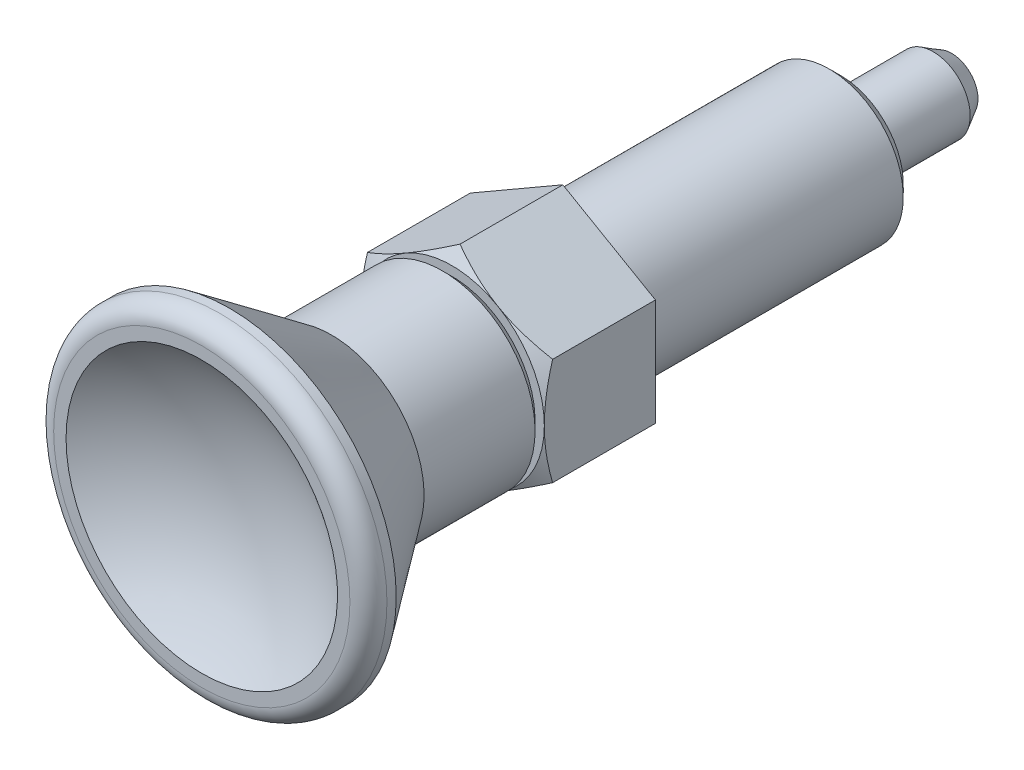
ISO-10303-21;
HEADER;
FILE_DESCRIPTION(('STEP AP214'),'2;1');
FILE_NAME('part.step','',(''),(''),'','','');
FILE_SCHEMA(('AUTOMOTIVE_DESIGN { 1 0 10303 214 1 1 1 1 }'));
ENDSEC;
DATA;
#1=APPLICATION_CONTEXT('core data for automotive mechanical design processes');
#2=APPLICATION_PROTOCOL_DEFINITION('international standard','automotive_design',2000,#1);
#3=PRODUCT_CONTEXT('',#1,'mechanical');
#4=PRODUCT('Part','Part','',(#3));
#5=PRODUCT_RELATED_PRODUCT_CATEGORY('part','',(#4));
#6=PRODUCT_DEFINITION_FORMATION('','',#4);
#7=PRODUCT_DEFINITION_CONTEXT('part definition',#1,'design');
#8=PRODUCT_DEFINITION('design','',#6,#7);
#9=PRODUCT_DEFINITION_SHAPE('','',#8);
#10=(LENGTH_UNIT() NAMED_UNIT(*) SI_UNIT(.MILLI.,.METRE.));
#11=(NAMED_UNIT(*) PLANE_ANGLE_UNIT() SI_UNIT($,.RADIAN.));
#12=(NAMED_UNIT(*) SI_UNIT($,.STERADIAN.) SOLID_ANGLE_UNIT());
#13=UNCERTAINTY_MEASURE_WITH_UNIT(LENGTH_MEASURE(1.E-05),#10,'distance_accuracy_value','');
#14=(GEOMETRIC_REPRESENTATION_CONTEXT(3) GLOBAL_UNCERTAINTY_ASSIGNED_CONTEXT((#13)) GLOBAL_UNIT_ASSIGNED_CONTEXT((#10,
#11,#12)) REPRESENTATION_CONTEXT('',''));
#15=CARTESIAN_POINT('',(0.,0.,0.));
#16=DIRECTION('',(0.,0.,1.));
#17=DIRECTION('',(1.,0.,0.));
#18=AXIS2_PLACEMENT_3D('',#15,#16,#17);
#19=CARTESIAN_POINT('',(0.,0.,4.2679491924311));
#20=DIRECTION('',(0.,0.,-1.));
#21=DIRECTION('',(1.,0.,0.));
#22=AXIS2_PLACEMENT_3D('',#19,#20,#21);
#23=CONICAL_SURFACE('',#22,8.,1.0471975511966);
#24=CARTESIAN_POINT('',(-5.,7.83582824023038,3.52018185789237));
#25=CARTESIAN_POINT('',(-5.,7.61675258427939,3.62677894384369));
#26=CARTESIAN_POINT('',(-5.,7.39718272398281,3.73237731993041));
#27=CARTESIAN_POINT('',(-5.,6.95679209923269,3.94101657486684));
#28=CARTESIAN_POINT('',(-5.,6.73597115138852,4.04405706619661));
#29=CARTESIAN_POINT('',(-5.,6.29171673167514,4.24752156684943));
#30=CARTESIAN_POINT('',(-5.,6.06827562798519,4.34792896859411));
#31=CARTESIAN_POINT('',(-5.,5.61964466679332,4.54474266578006));
#32=CARTESIAN_POINT('',(-5.,5.39445489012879,4.64114914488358));
#33=CARTESIAN_POINT('',(-5.,4.93438073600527,4.83205603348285));
#34=CARTESIAN_POINT('',(-5.,4.69942447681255,4.92638413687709));
#35=CARTESIAN_POINT('',(-5.,4.22679335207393,5.10809698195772));
#36=CARTESIAN_POINT('',(-5.,3.98911818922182,5.19548095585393));
#37=CARTESIAN_POINT('',(-5.,3.51109032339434,5.361071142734));
#38=CARTESIAN_POINT('',(-5.,3.27074388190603,5.43929525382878));
#39=CARTESIAN_POINT('',(-5.,2.78660382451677,5.58410963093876));
#40=CARTESIAN_POINT('',(-5.,2.54281129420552,5.65070347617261));
#41=CARTESIAN_POINT('',(-5.,2.05301710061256,5.76875493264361));
#42=CARTESIAN_POINT('',(-5.,1.80703640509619,5.8202979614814));
#43=CARTESIAN_POINT('',(-5.,1.31193168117,5.90539626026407));
#44=CARTESIAN_POINT('',(-5.,1.06280797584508,5.9389533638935));
#45=CARTESIAN_POINT('',(-5.,0.565948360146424,5.98496717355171));
#46=CARTESIAN_POINT('',(-5.,0.318238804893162,5.99770143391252));
#47=CARTESIAN_POINT('',(-5.,-0.177377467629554,6.00172580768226));
#48=CARTESIAN_POINT('',(-5.,-0.42528418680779,5.99301571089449));
#49=CARTESIAN_POINT('',(-5.,-0.84377235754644,5.96083600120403));
#50=CARTESIAN_POINT('',(-5.,-1.01479089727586,5.94270146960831));
#51=CARTESIAN_POINT('',(-5.,-1.35562158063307,5.89731277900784));
#52=CARTESIAN_POINT('',(-5.,-1.52543356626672,5.87005744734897));
#53=CARTESIAN_POINT('',(-5.,-2.03280883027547,5.77603792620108));
#54=CARTESIAN_POINT('',(-5.,-2.36813213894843,5.69703587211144));
#55=CARTESIAN_POINT('',(-5.,-2.86963272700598,5.55946652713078));
#56=CARTESIAN_POINT('',(-5.,-3.03839424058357,5.50977811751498));
#57=CARTESIAN_POINT('',(-5.,-3.37427940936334,5.40509537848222));
#58=CARTESIAN_POINT('',(-5.,-3.54140305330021,5.35010101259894));
#59=CARTESIAN_POINT('',(-5.,-3.8740625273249,5.23570084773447));
#60=CARTESIAN_POINT('',(-5.,-4.03959882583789,5.17629639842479));
#61=CARTESIAN_POINT('',(-5.,-4.36929036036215,5.05378935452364));
#62=CARTESIAN_POINT('',(-5.,-4.53344561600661,4.99068681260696));
#63=CARTESIAN_POINT('',(-5.,-4.93359002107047,4.83251408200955));
#64=CARTESIAN_POINT('',(-5.,-5.16891080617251,4.73575576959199));
#65=CARTESIAN_POINT('',(-5.,-5.63743106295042,4.53721704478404));
#66=CARTESIAN_POINT('',(-5.,-5.87063037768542,4.43543626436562));
#67=CARTESIAN_POINT('',(-5.,-6.33531777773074,4.22790414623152));
#68=CARTESIAN_POINT('',(-5.,-6.56680543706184,4.12215185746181));
#69=CARTESIAN_POINT('',(-5.,-7.02832278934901,3.90750642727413));
#70=CARTESIAN_POINT('',(-5.,-7.25835244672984,3.79861320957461));
#71=CARTESIAN_POINT('',(-5.,-7.71747583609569,3.57816832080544));
#72=CARTESIAN_POINT('',(-5.,-7.94656809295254,3.46661358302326));
#73=CARTESIAN_POINT('',(-5.,-8.40373705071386,3.2414402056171));
#74=CARTESIAN_POINT('',(-5.,-8.63181374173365,3.12782154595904));
#75=CARTESIAN_POINT('',(-5.,-9.31470112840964,2.78447519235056));
#76=CARTESIAN_POINT('',(-5.,-9.76824174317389,2.55222195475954));
#77=CARTESIAN_POINT('',(-5.,-10.6324695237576,2.10400639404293));
#78=CARTESIAN_POINT('',(-5.,-11.0433644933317,1.88844288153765));
#79=CARTESIAN_POINT('',(-5.,-11.863638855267,1.45441184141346));
#80=CARTESIAN_POINT('',(-5.,-12.2730181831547,1.23594419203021));
#81=CARTESIAN_POINT('',(-5.,-13.0894643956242,0.797423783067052));
#82=CARTESIAN_POINT('',(-5.,-13.4965345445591,0.577377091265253));
#83=CARTESIAN_POINT('',(-5.,-14.3097130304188,0.135572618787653));
#84=CARTESIAN_POINT('',(-5.,-14.7158214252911,-0.0861850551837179));
#85=CARTESIAN_POINT('',(-5.,-15.1215799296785,-0.308576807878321));
#86=B_SPLINE_CURVE_WITH_KNOTS('',3,(#24,#25,#26,#27,#28,#29,#30,#31,#32,#33,#34,#35,#36,#37,#38,
#39,#40,#41,#42,#43,#44,#45,#46,#47,#48,#49,#50,#51,#52,#53,#54,#55,#56,#57,#58,#59,#60,#61,#62,
#63,#64,#65,#66,#67,#68,#69,#70,#71,#72,#73,#74,#75,#76,#77,#78,#79,#80,#81,#82,#83,#84,#85),
.UNSPECIFIED.,.F.,.F.,(4,2,2,2,2,2,2,2,2,2,2,2,2,2,2,2,2,2,2,2,2,2,2,2,2,2,2,2,2,2,4),(0.,
0.730907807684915,1.46192568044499,2.19678752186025,2.93161559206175,3.69108328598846,
4.45063483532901,5.20867656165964,5.96648458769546,6.71990430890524,7.47324720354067,
8.21646418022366,8.95968844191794,9.47537174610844,9.99112137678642,11.0231580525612,
11.5508843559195,12.0786142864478,12.6061833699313,13.1337449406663,13.8969744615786,
14.6602599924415,15.4237294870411,16.1872175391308,16.9516324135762,17.7160547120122,
19.2446573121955,20.6366654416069,22.0287321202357,23.4169424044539,24.8050668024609),.UNSPECIFIED.);
#87=CARTESIAN_POINT('',(-5.,-2.8867513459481,5.55341801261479));
#88=VERTEX_POINT('',#87);
#89=CARTESIAN_POINT('',(-5.,0.,6.));
#90=VERTEX_POINT('',#89);
#91=EDGE_CURVE('E9',#88,#90,#86,.F.);
#92=ORIENTED_EDGE('',*,*,#91,.F.);
#93=CARTESIAN_POINT('',(0.000200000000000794,-5.77361816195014,5.55335134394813));
#94=CARTESIAN_POINT('',(-0.219534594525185,-5.64675433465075,5.62661343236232));
#95=CARTESIAN_POINT('',(-0.441148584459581,-5.51880543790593,5.69324867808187));
#96=CARTESIAN_POINT('',(-0.888213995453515,-5.26069210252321,5.80956100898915));
#97=CARTESIAN_POINT('',(-1.11367335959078,-5.13052307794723,5.85919695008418));
#98=CARTESIAN_POINT('',(-1.56183230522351,-4.87177839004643,5.93644897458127));
#99=CARTESIAN_POINT('',(-1.7844620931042,-4.74324302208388,5.96457962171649));
#100=CARTESIAN_POINT('',(-2.11918990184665,-4.54998783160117,5.98980507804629));
#101=CARTESIAN_POINT('',(-2.23084219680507,-4.48552534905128,5.99538654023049));
#102=CARTESIAN_POINT('',(-2.45424997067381,-4.35654081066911,6.00079778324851));
#103=CARTESIAN_POINT('',(-2.56600544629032,-4.2920187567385,6.00062774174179));
#104=CARTESIAN_POINT('',(-2.87218423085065,-4.11524635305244,5.99224636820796));
#105=CARTESIAN_POINT('',(-3.06650608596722,-4.00305457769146,5.97817022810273));
#106=CARTESIAN_POINT('',(-3.45386010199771,-3.77941563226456,5.93353474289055));
#107=CARTESIAN_POINT('',(-3.64689090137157,-3.66796924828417,5.90296013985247));
#108=CARTESIAN_POINT('',(-4.03502534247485,-3.44387972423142,5.82653150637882));
#109=CARTESIAN_POINT('',(-4.23007999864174,-3.33126486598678,5.7803536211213));
#110=CARTESIAN_POINT('',(-4.61728034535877,-3.10771464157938,5.67554820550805));
#111=CARTESIAN_POINT('',(-4.80943099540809,-2.99677641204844,5.61694529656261));
#112=CARTESIAN_POINT('',(-5.0002,-2.88663587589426,5.55335134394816));
#113=B_SPLINE_CURVE_WITH_KNOTS('',3,(#93,#94,#95,#96,#97,#98,#99,#100,#101,#102,#103,#104,#105,
#106,#107,#108,#109,#110,#111,#112),.UNSPECIFIED.,.F.,.F.,(4,2,2,2,2,2,2,2,2,4),(0.,
0.792555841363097,1.58701660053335,2.36181537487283,2.74884076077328,3.13585419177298,
3.80962362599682,4.48401723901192,5.17336882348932,5.86136694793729),.UNSPECIFIED.);
#114=CARTESIAN_POINT('',(-2.50000000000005,-4.33012701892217,6.));
#115=VERTEX_POINT('',#114);
#116=EDGE_CURVE('E203',#115,#88,#113,.T.);
#117=ORIENTED_EDGE('',*,*,#116,.F.);
#118=CARTESIAN_POINT('',(0.,0.,6.));
#119=DIRECTION('',(0.,0.,1.));
#120=DIRECTION('',(-1.,0.,0.));
#121=AXIS2_PLACEMENT_3D('',#118,#119,#120);
#122=CIRCLE('',#121,5.);
#123=EDGE_CURVE('E124',#90,#115,#122,.T.);
#124=ORIENTED_EDGE('',*,*,#123,.F.);
#125=EDGE_LOOP('',(#92,#117,#124));
#126=FACE_BOUND('',#125,.T.);
#127=ADVANCED_FACE('F14',(#126),#23,.T.);
#128=CARTESIAN_POINT('',(-5.,2.8867513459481,5.55341801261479));
#129=VERTEX_POINT('',#128);
#130=EDGE_CURVE('E18',#90,#129,#86,.F.);
#131=ORIENTED_EDGE('',*,*,#130,.F.);
#132=CARTESIAN_POINT('',(-2.50000000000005,4.33012701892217,6.));
#133=VERTEX_POINT('',#132);
#134=EDGE_CURVE('E116',#133,#90,#122,.T.);
#135=ORIENTED_EDGE('',*,*,#134,.F.);
#136=CARTESIAN_POINT('',(-5.0002,2.88663587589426,5.55335134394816));
#137=CARTESIAN_POINT('',(-4.78046540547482,3.01349970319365,5.62661343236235));
#138=CARTESIAN_POINT('',(-4.55885141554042,3.14144859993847,5.69324867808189));
#139=CARTESIAN_POINT('',(-4.11178600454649,3.39956193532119,5.80956100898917));
#140=CARTESIAN_POINT('',(-3.88632664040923,3.52973095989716,5.85919695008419));
#141=CARTESIAN_POINT('',(-3.43816769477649,3.78847564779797,5.93644897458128));
#142=CARTESIAN_POINT('',(-3.21553790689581,3.91701101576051,5.96457962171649));
#143=CARTESIAN_POINT('',(-2.88081009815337,4.11026620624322,5.98980507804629));
#144=CARTESIAN_POINT('',(-2.76915780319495,4.17472868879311,5.99538654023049));
#145=CARTESIAN_POINT('',(-2.54575002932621,4.30371322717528,6.00079778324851));
#146=CARTESIAN_POINT('',(-2.4339945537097,4.36823528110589,6.00062774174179));
#147=CARTESIAN_POINT('',(-2.12781576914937,4.54500768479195,5.99224636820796));
#148=CARTESIAN_POINT('',(-1.9334939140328,4.65719946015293,5.97817022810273));
#149=CARTESIAN_POINT('',(-1.5461398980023,4.88083840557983,5.93353474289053));
#150=CARTESIAN_POINT('',(-1.35310909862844,4.99228478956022,5.90296013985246));
#151=CARTESIAN_POINT('',(-0.96497465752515,5.21637431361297,5.8265315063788));
#152=CARTESIAN_POINT('',(-0.769920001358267,5.32898917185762,5.78035362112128));
#153=CARTESIAN_POINT('',(-0.382719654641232,5.55253939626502,5.67554820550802));
#154=CARTESIAN_POINT('',(-0.190569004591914,5.66347762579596,5.61694529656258));
#155=CARTESIAN_POINT('',(0.000200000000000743,5.77361816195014,5.55335134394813));
#156=B_SPLINE_CURVE_WITH_KNOTS('',3,(#136,#137,#138,#139,#140,#141,#142,#143,#144,#145,#146,
#147,#148,#149,#150,#151,#152,#153,#154,#155),.UNSPECIFIED.,.F.,.F.,(4,2,2,2,2,2,2,2,2,4),(0.,
0.792555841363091,1.58701660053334,2.36181537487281,2.74884076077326,3.13585419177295,
3.8096236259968,4.48401723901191,5.17336882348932,5.86136694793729),.UNSPECIFIED.);
#157=EDGE_CURVE('E262',#129,#133,#156,.T.);
#158=ORIENTED_EDGE('',*,*,#157,.F.);
#159=EDGE_LOOP('',(#131,#135,#158));
#160=FACE_BOUND('',#159,.T.);
#161=ADVANCED_FACE('F225',(#160),#23,.T.);
#162=CARTESIAN_POINT('',(0.,5.7735026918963,5.55341801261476));
#163=VERTEX_POINT('',#162);
#164=EDGE_CURVE('E112',#133,#163,#156,.T.);
#165=ORIENTED_EDGE('',*,*,#164,.F.);
#166=CARTESIAN_POINT('',(2.50000000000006,4.33012701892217,6.));
#167=VERTEX_POINT('',#166);
#168=EDGE_CURVE('E110',#167,#133,#122,.T.);
#169=ORIENTED_EDGE('',*,*,#168,.F.);
#170=CARTESIAN_POINT('',(-0.000199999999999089,5.77361816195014,5.55335134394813));
#171=CARTESIAN_POINT('',(0.219534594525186,5.64675433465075,5.62661343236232));
#172=CARTESIAN_POINT('',(0.441148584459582,5.51880543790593,5.69324867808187));
#173=CARTESIAN_POINT('',(0.888213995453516,5.26069210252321,5.80956100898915));
#174=CARTESIAN_POINT('',(1.11367335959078,5.13052307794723,5.85919695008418));
#175=CARTESIAN_POINT('',(1.56183230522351,4.87177839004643,5.93644897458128));
#176=CARTESIAN_POINT('',(1.7844620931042,4.74324302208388,5.96457962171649));
#177=CARTESIAN_POINT('',(2.11918990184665,4.54998783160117,5.98980507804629));
#178=CARTESIAN_POINT('',(2.23084219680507,4.48552534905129,5.99538654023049));
#179=CARTESIAN_POINT('',(2.45424997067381,4.35654081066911,6.00079778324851));
#180=CARTESIAN_POINT('',(2.56600544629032,4.2920187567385,6.00062774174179));
#181=CARTESIAN_POINT('',(2.87218423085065,4.11524635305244,5.99224636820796));
#182=CARTESIAN_POINT('',(3.06650608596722,4.00305457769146,5.97817022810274));
#183=CARTESIAN_POINT('',(3.45386010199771,3.77941563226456,5.93353474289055));
#184=CARTESIAN_POINT('',(3.64689090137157,3.66796924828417,5.90296013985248));
#185=CARTESIAN_POINT('',(4.03502534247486,3.44387972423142,5.82653150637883));
#186=CARTESIAN_POINT('',(4.23007999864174,3.33126486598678,5.78035362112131));
#187=CARTESIAN_POINT('',(4.61728034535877,3.10771464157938,5.67554820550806));
#188=CARTESIAN_POINT('',(4.80943099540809,2.99677641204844,5.61694529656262));
#189=CARTESIAN_POINT('',(5.0002,2.88663587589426,5.55335134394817));
#190=B_SPLINE_CURVE_WITH_KNOTS('',3,(#170,#171,#172,#173,#174,#175,#176,#177,#178,#179,#180,
#181,#182,#183,#184,#185,#186,#187,#188,#189),.UNSPECIFIED.,.F.,.F.,(4,2,2,2,2,2,2,2,2,4),(0.,
0.792555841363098,1.58701660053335,2.36181537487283,2.74884076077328,3.13585419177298,
3.80962362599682,4.48401723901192,5.17336882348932,5.86136694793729),.UNSPECIFIED.);
#191=EDGE_CURVE('E90',#163,#167,#190,.T.);
#192=ORIENTED_EDGE('',*,*,#191,.F.);
#193=EDGE_LOOP('',(#165,#169,#192));
#194=FACE_BOUND('',#193,.T.);
#195=ADVANCED_FACE('F111',(#194),#23,.T.);
#196=CARTESIAN_POINT('',(0.,-5.7735026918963,5.55341801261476));
#197=VERTEX_POINT('',#196);
#198=EDGE_CURVE('E198',#197,#115,#113,.T.);
#199=ORIENTED_EDGE('',*,*,#198,.F.);
#200=CARTESIAN_POINT('',(5.0002,-2.88663587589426,5.55335134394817));
#201=CARTESIAN_POINT('',(4.78046540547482,-3.01349970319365,5.62661343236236));
#202=CARTESIAN_POINT('',(4.55885141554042,-3.14144859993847,5.6932486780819));
#203=CARTESIAN_POINT('',(4.11178600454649,-3.39956193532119,5.80956100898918));
#204=CARTESIAN_POINT('',(3.88632664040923,-3.52973095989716,5.8591969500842));
#205=CARTESIAN_POINT('',(3.4381676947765,-3.78847564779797,5.93644897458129));
#206=CARTESIAN_POINT('',(3.21553790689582,-3.91701101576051,5.9645796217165));
#207=CARTESIAN_POINT('',(2.88081009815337,-4.11026620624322,5.9898050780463));
#208=CARTESIAN_POINT('',(2.76915780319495,-4.1747286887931,5.9953865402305));
#209=CARTESIAN_POINT('',(2.54575002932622,-4.30371322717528,6.00079778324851));
#210=CARTESIAN_POINT('',(2.4339945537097,-4.36823528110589,6.00062774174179));
#211=CARTESIAN_POINT('',(2.12781576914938,-4.54500768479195,5.99224636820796));
#212=CARTESIAN_POINT('',(1.9334939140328,-4.65719946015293,5.97817022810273));
#213=CARTESIAN_POINT('',(1.54613989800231,-4.88083840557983,5.93353474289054));
#214=CARTESIAN_POINT('',(1.35310909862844,-4.99228478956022,5.90296013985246));
#215=CARTESIAN_POINT('',(0.964974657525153,-5.21637431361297,5.8265315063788));
#216=CARTESIAN_POINT('',(0.76992000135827,-5.32898917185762,5.78035362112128));
#217=CARTESIAN_POINT('',(0.382719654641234,-5.55253939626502,5.67554820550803));
#218=CARTESIAN_POINT('',(0.190569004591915,-5.66347762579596,5.61694529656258));
#219=CARTESIAN_POINT('',(-0.000199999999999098,-5.77361816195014,5.55335134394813));
#220=B_SPLINE_CURVE_WITH_KNOTS('',3,(#200,#201,#202,#203,#204,#205,#206,#207,#208,#209,#210,
#211,#212,#213,#214,#215,#216,#217,#218,#219),.UNSPECIFIED.,.F.,.F.,(4,2,2,2,2,2,2,2,2,4),(0.,
0.792555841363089,1.58701660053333,2.36181537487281,2.74884076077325,3.13585419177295,
3.8096236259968,4.48401723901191,5.17336882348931,5.86136694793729),.UNSPECIFIED.);
#221=CARTESIAN_POINT('',(2.50000000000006,-4.33012701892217,6.));
#222=VERTEX_POINT('',#221);
#223=EDGE_CURVE('E100',#222,#197,#220,.T.);
#224=ORIENTED_EDGE('',*,*,#223,.F.);
#225=EDGE_CURVE('E123',#115,#222,#122,.T.);
#226=ORIENTED_EDGE('',*,*,#225,.F.);
#227=EDGE_LOOP('',(#199,#224,#226));
#228=FACE_BOUND('',#227,.T.);
#229=ADVANCED_FACE('F243',(#228),#23,.T.);
#230=CARTESIAN_POINT('',(5.,2.8867513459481,5.5534180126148));
#231=VERTEX_POINT('',#230);
#232=EDGE_CURVE('E94',#167,#231,#190,.T.);
#233=ORIENTED_EDGE('',*,*,#232,.F.);
#234=CARTESIAN_POINT('',(5.,0.,6.));
#235=VERTEX_POINT('',#234);
#236=EDGE_CURVE('E106',#235,#167,#122,.T.);
#237=ORIENTED_EDGE('',*,*,#236,.F.);
#238=CARTESIAN_POINT('',(5.,7.83582824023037,3.52018185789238));
#239=CARTESIAN_POINT('',(5.,7.61675258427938,3.6267789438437));
#240=CARTESIAN_POINT('',(5.,7.39718272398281,3.73237731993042));
#241=CARTESIAN_POINT('',(5.,6.95679209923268,3.94101657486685));
#242=CARTESIAN_POINT('',(5.,6.73597115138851,4.04405706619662));
#243=CARTESIAN_POINT('',(5.,6.29171673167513,4.24752156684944));
#244=CARTESIAN_POINT('',(5.,6.06827562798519,4.34792896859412));
#245=CARTESIAN_POINT('',(5.,5.61964466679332,4.54474266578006));
#246=CARTESIAN_POINT('',(5.,5.39445489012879,4.64114914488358));
#247=CARTESIAN_POINT('',(5.,4.93438073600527,4.83205603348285));
#248=CARTESIAN_POINT('',(5.,4.69942447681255,4.9263841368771));
#249=CARTESIAN_POINT('',(5.,4.22679335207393,5.10809698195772));
#250=CARTESIAN_POINT('',(5.,3.98911818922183,5.19548095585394));
#251=CARTESIAN_POINT('',(5.,3.51109032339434,5.361071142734));
#252=CARTESIAN_POINT('',(5.,3.27074388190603,5.43929525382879));
#253=CARTESIAN_POINT('',(5.,2.78660382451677,5.58410963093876));
#254=CARTESIAN_POINT('',(5.,2.54281129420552,5.65070347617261));
#255=CARTESIAN_POINT('',(5.,2.05301710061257,5.76875493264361));
#256=CARTESIAN_POINT('',(5.,1.80703640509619,5.8202979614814));
#257=CARTESIAN_POINT('',(5.,1.31193168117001,5.90539626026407));
#258=CARTESIAN_POINT('',(5.,1.06280797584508,5.9389533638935));
#259=CARTESIAN_POINT('',(5.,0.56594836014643,5.98496717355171));
#260=CARTESIAN_POINT('',(5.,0.318238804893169,5.99770143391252));
#261=CARTESIAN_POINT('',(5.,-0.177377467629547,6.00172580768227));
#262=CARTESIAN_POINT('',(5.,-0.425284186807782,5.9930157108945));
#263=CARTESIAN_POINT('',(5.,-0.843772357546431,5.96083600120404));
#264=CARTESIAN_POINT('',(5.,-1.01479089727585,5.94270146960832));
#265=CARTESIAN_POINT('',(5.,-1.35562158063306,5.89731277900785));
#266=CARTESIAN_POINT('',(5.,-1.52543356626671,5.87005744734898));
#267=CARTESIAN_POINT('',(5.,-2.03280883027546,5.77603792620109));
#268=CARTESIAN_POINT('',(5.,-2.36813213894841,5.69703587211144));
#269=CARTESIAN_POINT('',(5.,-2.86963272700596,5.55946652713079));
#270=CARTESIAN_POINT('',(5.,-3.03839424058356,5.50977811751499));
#271=CARTESIAN_POINT('',(5.,-3.37427940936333,5.40509537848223));
#272=CARTESIAN_POINT('',(5.,-3.54140305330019,5.35010101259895));
#273=CARTESIAN_POINT('',(5.,-3.87406252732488,5.23570084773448));
#274=CARTESIAN_POINT('',(5.,-4.03959882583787,5.1762963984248));
#275=CARTESIAN_POINT('',(5.,-4.36929036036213,5.05378935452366));
#276=CARTESIAN_POINT('',(5.,-4.53344561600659,4.99068681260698));
#277=CARTESIAN_POINT('',(5.,-4.93359002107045,4.83251408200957));
#278=CARTESIAN_POINT('',(5.,-5.16891080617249,4.735755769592));
#279=CARTESIAN_POINT('',(5.,-5.6374310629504,4.53721704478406));
#280=CARTESIAN_POINT('',(5.,-5.87063037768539,4.43543626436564));
#281=CARTESIAN_POINT('',(5.,-6.33531777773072,4.22790414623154));
#282=CARTESIAN_POINT('',(5.,-6.56680543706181,4.12215185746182));
#283=CARTESIAN_POINT('',(5.,-7.02832278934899,3.90750642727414));
#284=CARTESIAN_POINT('',(5.,-7.25835244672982,3.79861320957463));
#285=CARTESIAN_POINT('',(5.,-7.71747583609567,3.57816832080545));
#286=CARTESIAN_POINT('',(5.,-7.94656809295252,3.46661358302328));
#287=CARTESIAN_POINT('',(5.,-8.40373705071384,3.24144020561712));
#288=CARTESIAN_POINT('',(5.,-8.63181374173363,3.12782154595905));
#289=CARTESIAN_POINT('',(5.,-9.31470112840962,2.78447519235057));
#290=CARTESIAN_POINT('',(5.,-9.76824174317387,2.55222195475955));
#291=CARTESIAN_POINT('',(5.,-10.6324695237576,2.10400639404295));
#292=CARTESIAN_POINT('',(5.,-11.0433644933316,1.88844288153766));
#293=CARTESIAN_POINT('',(5.,-11.863638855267,1.45441184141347));
#294=CARTESIAN_POINT('',(5.,-12.2730181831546,1.23594419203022));
#295=CARTESIAN_POINT('',(5.,-13.0894643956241,0.79742378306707));
#296=CARTESIAN_POINT('',(5.,-13.496534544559,0.577377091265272));
#297=CARTESIAN_POINT('',(5.,-14.3097130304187,0.135572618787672));
#298=CARTESIAN_POINT('',(5.,-14.715821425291,-0.0861850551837));
#299=CARTESIAN_POINT('',(5.,-15.1215799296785,-0.308576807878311));
#300=B_SPLINE_CURVE_WITH_KNOTS('',3,(#238,#239,#240,#241,#242,#243,#244,#245,#246,#247,#248,
#249,#250,#251,#252,#253,#254,#255,#256,#257,#258,#259,#260,#261,#262,#263,#264,#265,#266,#267,
#268,#269,#270,#271,#272,#273,#274,#275,#276,#277,#278,#279,#280,#281,#282,#283,#284,#285,#286,
#287,#288,#289,#290,#291,#292,#293,#294,#295,#296,#297,#298,#299),.UNSPECIFIED.,.F.,.F.,(4,2,2,
2,2,2,2,2,2,2,2,2,2,2,2,2,2,2,2,2,2,2,2,2,2,2,2,2,2,2,4),(0.,0.730907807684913,1.46192568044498,
2.19678752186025,2.93161559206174,3.69108328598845,4.450634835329,5.20867656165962,
5.96648458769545,6.71990430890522,7.47324720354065,8.21646418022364,8.95968844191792,
9.47537174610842,9.99112137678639,11.0231580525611,11.5508843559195,12.0786142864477,
12.6061833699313,13.1337449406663,13.8969744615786,14.6602599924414,15.4237294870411,
16.1872175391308,16.9516324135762,17.7160547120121,19.2446573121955,20.6366654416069,
22.0287321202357,23.4169424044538,24.8050668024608),.UNSPECIFIED.);
#301=EDGE_CURVE('E41',#231,#235,#300,.T.);
#302=ORIENTED_EDGE('',*,*,#301,.F.);
#303=EDGE_LOOP('',(#233,#237,#302));
#304=FACE_BOUND('',#303,.T.);
#305=ADVANCED_FACE('F104',(#304),#23,.T.);
#306=CARTESIAN_POINT('',(5.,-2.8867513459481,5.5534180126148));
#307=VERTEX_POINT('',#306);
#308=EDGE_CURVE('E108',#307,#222,#220,.T.);
#309=ORIENTED_EDGE('',*,*,#308,.F.);
#310=EDGE_CURVE('E168',#235,#307,#300,.T.);
#311=ORIENTED_EDGE('',*,*,#310,.F.);
#312=EDGE_CURVE('E122',#222,#235,#122,.T.);
#313=ORIENTED_EDGE('',*,*,#312,.F.);
#314=EDGE_LOOP('',(#309,#311,#313));
#315=FACE_BOUND('',#314,.T.);
#316=ADVANCED_FACE('F227',(#315),#23,.T.);
#317=CARTESIAN_POINT('',(2.54308990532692E-12,0.,28.9999999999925));
#318=DIRECTION('',(0.,0.,1.));
#319=DIRECTION('',(-1.,0.,0.));
#320=AXIS2_PLACEMENT_3D('',#317,#318,#319);
#321=SPHERICAL_SURFACE('',#320,11.9999999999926);
#322=CARTESIAN_POINT('',(0.,0.,19.5));
#323=DIRECTION('',(0.,0.,1.));
#324=DIRECTION('',(0.,-1.,0.));
#325=AXIS2_PLACEMENT_3D('',#322,#323,#324);
#326=CIRCLE('',#325,7.3314391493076);
#327=CARTESIAN_POINT('',(0.,-7.3314391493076,19.5));
#328=VERTEX_POINT('',#327);
#329=EDGE_CURVE('E165',#328,#328,#326,.T.);
#330=ORIENTED_EDGE('',*,*,#329,.T.);
#331=EDGE_LOOP('',(#330));
#332=FACE_BOUND('',#331,.T.);
#333=ADVANCED_FACE('F16',(#332),#321,.F.);
#334=CARTESIAN_POINT('',(7.3314391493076,0.,19.5));
#335=DIRECTION('',(0.,0.,1.));
#336=DIRECTION('',(0.,-1.,0.));
#337=AXIS2_PLACEMENT_3D('',#334,#335,#336);
#338=PLANE('',#337);
#339=CARTESIAN_POINT('',(0.,0.,19.5));
#340=DIRECTION('',(0.,0.,1.));
#341=DIRECTION('',(0.,-1.,0.));
#342=AXIS2_PLACEMENT_3D('',#339,#340,#341);
#343=CIRCLE('',#342,8.);
#344=CARTESIAN_POINT('',(0.,-8.,19.5));
#345=VERTEX_POINT('',#344);
#346=EDGE_CURVE('E162',#345,#345,#343,.T.);
#347=ORIENTED_EDGE('',*,*,#346,.T.);
#348=EDGE_LOOP('',(#347));
#349=FACE_BOUND('',#348,.T.);
#350=ORIENTED_EDGE('',*,*,#329,.F.);
#351=EDGE_LOOP('',(#350));
#352=FACE_BOUND('',#351,.T.);
#353=ADVANCED_FACE('F241',(#349,#352),#338,.T.);
#354=CARTESIAN_POINT('',(0.,0.,18.5000000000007));
#355=DIRECTION('',(0.,0.,1.));
#356=DIRECTION('',(0.,-1.,0.));
#357=AXIS2_PLACEMENT_3D('',#354,#355,#356);
#358=TOROIDAL_SURFACE('',#357,8.00000000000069,0.999999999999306);
#359=CARTESIAN_POINT('',(0.,0.,18.5));
#360=DIRECTION('',(0.,0.,1.));
#361=DIRECTION('',(0.,-1.,0.));
#362=AXIS2_PLACEMENT_3D('',#359,#360,#361);
#363=CIRCLE('',#362,9.);
#364=CARTESIAN_POINT('',(0.,-9.,18.5));
#365=VERTEX_POINT('',#364);
#366=EDGE_CURVE('E159',#365,#365,#363,.T.);
#367=ORIENTED_EDGE('',*,*,#366,.T.);
#368=EDGE_LOOP('',(#367));
#369=FACE_BOUND('',#368,.T.);
#370=ORIENTED_EDGE('',*,*,#346,.F.);
#371=EDGE_LOOP('',(#370));
#372=FACE_BOUND('',#371,.T.);
#373=ADVANCED_FACE('F335',(#369,#372),#358,.T.);
#374=CARTESIAN_POINT('',(0.,0.,-21.));
#375=DIRECTION('',(0.,0.,1.));
#376=DIRECTION('',(0.,-1.,0.));
#377=AXIS2_PLACEMENT_3D('',#374,#375,#376);
#378=CYLINDRICAL_SURFACE('',#377,9.);
#379=CARTESIAN_POINT('',(0.,0.,18.));
#380=DIRECTION('',(0.,0.,1.));
#381=DIRECTION('',(0.,-1.,0.));
#382=AXIS2_PLACEMENT_3D('',#379,#380,#381);
#383=CIRCLE('',#382,9.);
#384=CARTESIAN_POINT('',(0.,-9.,18.));
#385=VERTEX_POINT('',#384);
#386=EDGE_CURVE('E156',#385,#385,#383,.T.);
#387=ORIENTED_EDGE('',*,*,#386,.T.);
#388=EDGE_LOOP('',(#387));
#389=FACE_BOUND('',#388,.T.);
#390=ORIENTED_EDGE('',*,*,#366,.F.);
#391=EDGE_LOOP('',(#390));
#392=FACE_BOUND('',#391,.T.);
#393=ADVANCED_FACE('F331',(#389,#392),#378,.T.);
#394=CARTESIAN_POINT('',(0.,0.,18.));
#395=DIRECTION('',(0.,0.,1.));
#396=DIRECTION('',(0.,-1.,0.));
#397=AXIS2_PLACEMENT_3D('',#394,#395,#396);
#398=CONICAL_SURFACE('',#397,9.,0.628318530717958);
#399=CARTESIAN_POINT('',(0.,0.,12.4944723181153));
#400=DIRECTION('',(0.,0.,1.));
#401=DIRECTION('',(0.,-1.,0.));
#402=AXIS2_PLACEMENT_3D('',#399,#400,#401);
#403=CIRCLE('',#402,5.);
#404=CARTESIAN_POINT('',(0.,-5.,12.4944723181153));
#405=VERTEX_POINT('',#404);
#406=EDGE_CURVE('E153',#405,#405,#403,.T.);
#407=ORIENTED_EDGE('',*,*,#406,.T.);
#408=EDGE_LOOP('',(#407));
#409=FACE_BOUND('',#408,.T.);
#410=ORIENTED_EDGE('',*,*,#386,.F.);
#411=EDGE_LOOP('',(#410));
#412=FACE_BOUND('',#411,.T.);
#413=ADVANCED_FACE('F327',(#409,#412),#398,.T.);
#414=CARTESIAN_POINT('',(0.,0.,-21.));
#415=DIRECTION('',(0.,0.,1.));
#416=DIRECTION('',(0.,-1.,0.));
#417=AXIS2_PLACEMENT_3D('',#414,#415,#416);
#418=CYLINDRICAL_SURFACE('',#417,5.);
#419=CARTESIAN_POINT('',(0.,0.,6.5));
#420=DIRECTION('',(0.,0.,1.));
#421=DIRECTION('',(0.,-1.,0.));
#422=AXIS2_PLACEMENT_3D('',#419,#420,#421);
#423=CIRCLE('',#422,5.);
#424=CARTESIAN_POINT('',(0.,-5.,6.5));
#425=VERTEX_POINT('',#424);
#426=EDGE_CURVE('E150',#425,#425,#423,.T.);
#427=ORIENTED_EDGE('',*,*,#426,.T.);
#428=EDGE_LOOP('',(#427));
#429=FACE_BOUND('',#428,.T.);
#430=ORIENTED_EDGE('',*,*,#406,.F.);
#431=EDGE_LOOP('',(#430));
#432=FACE_BOUND('',#431,.T.);
#433=ADVANCED_FACE('F323',(#429,#432),#418,.T.);
#434=CARTESIAN_POINT('',(0.,0.,6.5));
#435=DIRECTION('',(0.,0.,1.));
#436=DIRECTION('',(0.,-1.,0.));
#437=AXIS2_PLACEMENT_3D('',#434,#435,#436);
#438=CONICAL_SURFACE('',#437,5.,0.785398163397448);
#439=CARTESIAN_POINT('',(0.,0.,6.));
#440=DIRECTION('',(0.,0.,1.));
#441=DIRECTION('',(0.,-1.,0.));
#442=AXIS2_PLACEMENT_3D('',#439,#440,#441);
#443=CIRCLE('',#442,4.5);
#444=CARTESIAN_POINT('',(0.,-4.5,6.));
#445=VERTEX_POINT('',#444);
#446=EDGE_CURVE('E147',#445,#445,#443,.T.);
#447=ORIENTED_EDGE('',*,*,#446,.T.);
#448=EDGE_LOOP('',(#447));
#449=FACE_BOUND('',#448,.T.);
#450=ORIENTED_EDGE('',*,*,#426,.F.);
#451=EDGE_LOOP('',(#450));
#452=FACE_BOUND('',#451,.T.);
#453=ADVANCED_FACE('F312',(#449,#452),#438,.T.);
#454=CARTESIAN_POINT('',(5.,0.,6.));
#455=DIRECTION('',(0.,0.,-1.));
#456=DIRECTION('',(1.,0.,0.));
#457=AXIS2_PLACEMENT_3D('',#454,#455,#456);
#458=PLANE('',#457);
#459=ORIENTED_EDGE('',*,*,#446,.F.);
#460=EDGE_LOOP('',(#459));
#461=FACE_BOUND('',#460,.T.);
#462=ORIENTED_EDGE('',*,*,#123,.T.);
#463=ORIENTED_EDGE('',*,*,#225,.T.);
#464=ORIENTED_EDGE('',*,*,#312,.T.);
#465=ORIENTED_EDGE('',*,*,#236,.T.);
#466=ORIENTED_EDGE('',*,*,#168,.T.);
#467=ORIENTED_EDGE('',*,*,#134,.T.);
#468=EDGE_LOOP('',(#462,#463,#464,#465,#466,#467));
#469=FACE_BOUND('',#468,.T.);
#470=ADVANCED_FACE('F119',(#461,#469),#458,.F.);
#471=CARTESIAN_POINT('',(5.,2.8867513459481,-2.));
#472=DIRECTION('',(0.500000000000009,0.866025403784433,0.));
#473=DIRECTION('',(-0.866025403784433,0.500000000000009,0.));
#474=AXIS2_PLACEMENT_3D('',#471,#472,#473);
#475=PLANE('',#474);
#476=DIRECTION('',(-0.866025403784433,0.500000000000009,0.));
#477=VECTOR('',#476,1.);
#478=CARTESIAN_POINT('',(5.5,2.59807621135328,0.));
#479=LINE('',#478,#477);
#480=CARTESIAN_POINT('',(5.,2.8867513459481,0.));
#481=VERTEX_POINT('',#480);
#482=CARTESIAN_POINT('',(0.,5.7735026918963,0.));
#483=VERTEX_POINT('',#482);
#484=EDGE_CURVE('E128',#481,#483,#479,.T.);
#485=ORIENTED_EDGE('',*,*,#484,.T.);
#486=DIRECTION('',(0.,0.,1.));
#487=VECTOR('',#486,1.);
#488=CARTESIAN_POINT('',(0.,5.7735026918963,-2.));
#489=LINE('',#488,#487);
#490=EDGE_CURVE('E96',#483,#163,#489,.T.);
#491=ORIENTED_EDGE('',*,*,#490,.T.);
#492=ORIENTED_EDGE('',*,*,#191,.T.);
#493=ORIENTED_EDGE('',*,*,#232,.T.);
#494=DIRECTION('',(0.,0.,1.));
#495=VECTOR('',#494,1.);
#496=CARTESIAN_POINT('',(5.,2.8867513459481,-2.));
#497=LINE('',#496,#495);
#498=EDGE_CURVE('E282',#481,#231,#497,.T.);
#499=ORIENTED_EDGE('',*,*,#498,.F.);
#500=EDGE_LOOP('',(#485,#491,#492,#493,#499));
#501=FACE_BOUND('',#500,.T.);
#502=ADVANCED_FACE('F92',(#501),#475,.T.);
#503=CARTESIAN_POINT('',(0.,5.7735026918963,-2.));
#504=DIRECTION('',(-0.500000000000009,0.866025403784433,0.));
#505=DIRECTION('',(-0.866025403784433,-0.500000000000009,0.));
#506=AXIS2_PLACEMENT_3D('',#503,#504,#505);
#507=PLANE('',#506);
#508=DIRECTION('',(-0.866025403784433,-0.500000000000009,0.));
#509=VECTOR('',#508,1.);
#510=CARTESIAN_POINT('',(0.499999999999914,6.06217782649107,0.));
#511=LINE('',#510,#509);
#512=CARTESIAN_POINT('',(-5.,2.8867513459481,0.));
#513=VERTEX_POINT('',#512);
#514=EDGE_CURVE('E266',#483,#513,#511,.T.);
#515=ORIENTED_EDGE('',*,*,#514,.T.);
#516=DIRECTION('',(0.,0.,1.));
#517=VECTOR('',#516,1.);
#518=CARTESIAN_POINT('',(-5.,2.8867513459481,-2.));
#519=LINE('',#518,#517);
#520=EDGE_CURVE('E269',#513,#129,#519,.T.);
#521=ORIENTED_EDGE('',*,*,#520,.T.);
#522=ORIENTED_EDGE('',*,*,#157,.T.);
#523=ORIENTED_EDGE('',*,*,#164,.T.);
#524=ORIENTED_EDGE('',*,*,#490,.F.);
#525=EDGE_LOOP('',(#515,#521,#522,#523,#524));
#526=FACE_BOUND('',#525,.T.);
#527=ADVANCED_FACE('F192',(#526),#507,.T.);
#528=CARTESIAN_POINT('',(-5.,2.8867513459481,-2.));
#529=DIRECTION('',(-1.,0.,0.));
#530=DIRECTION('',(0.,-1.,0.));
#531=AXIS2_PLACEMENT_3D('',#528,#529,#530);
#532=PLANE('',#531);
#533=DIRECTION('',(0.,-1.,0.));
#534=VECTOR('',#533,1.);
#535=CARTESIAN_POINT('',(-5.,0.,0.));
#536=LINE('',#535,#534);
#537=CARTESIAN_POINT('',(-5.,-2.8867513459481,0.));
#538=VERTEX_POINT('',#537);
#539=EDGE_CURVE('E275',#513,#538,#536,.T.);
#540=ORIENTED_EDGE('',*,*,#539,.T.);
#541=DIRECTION('',(0.,0.,1.));
#542=VECTOR('',#541,1.);
#543=CARTESIAN_POINT('',(-5.,-2.8867513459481,-2.));
#544=LINE('',#543,#542);
#545=EDGE_CURVE('E258',#538,#88,#544,.T.);
#546=ORIENTED_EDGE('',*,*,#545,.T.);
#547=ORIENTED_EDGE('',*,*,#91,.T.);
#548=ORIENTED_EDGE('',*,*,#130,.T.);
#549=ORIENTED_EDGE('',*,*,#520,.F.);
#550=EDGE_LOOP('',(#540,#546,#547,#548,#549));
#551=FACE_BOUND('',#550,.T.);
#552=ADVANCED_FACE('F212',(#551),#532,.T.);
#553=CARTESIAN_POINT('',(-5.,-2.8867513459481,-2.));
#554=DIRECTION('',(-0.500000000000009,-0.866025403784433,0.));
#555=DIRECTION('',(0.866025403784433,-0.500000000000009,0.));
#556=AXIS2_PLACEMENT_3D('',#553,#554,#555);
#557=PLANE('',#556);
#558=DIRECTION('',(0.866025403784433,-0.500000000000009,0.));
#559=VECTOR('',#558,1.);
#560=CARTESIAN_POINT('',(0.499999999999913,-6.06217782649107,0.));
#561=LINE('',#560,#559);
#562=CARTESIAN_POINT('',(0.,-5.7735026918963,0.));
#563=VERTEX_POINT('',#562);
#564=EDGE_CURVE('E257',#538,#563,#561,.T.);
#565=ORIENTED_EDGE('',*,*,#564,.T.);
#566=DIRECTION('',(0.,0.,1.));
#567=VECTOR('',#566,1.);
#568=CARTESIAN_POINT('',(0.,-5.7735026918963,-2.));
#569=LINE('',#568,#567);
#570=EDGE_CURVE('E249',#563,#197,#569,.T.);
#571=ORIENTED_EDGE('',*,*,#570,.T.);
#572=ORIENTED_EDGE('',*,*,#198,.T.);
#573=ORIENTED_EDGE('',*,*,#116,.T.);
#574=ORIENTED_EDGE('',*,*,#545,.F.);
#575=EDGE_LOOP('',(#565,#571,#572,#573,#574));
#576=FACE_BOUND('',#575,.T.);
#577=ADVANCED_FACE('F209',(#576),#557,.T.);
#578=CARTESIAN_POINT('',(0.,-5.7735026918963,-2.));
#579=DIRECTION('',(0.500000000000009,-0.866025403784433,0.));
#580=DIRECTION('',(0.866025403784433,0.500000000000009,0.));
#581=AXIS2_PLACEMENT_3D('',#578,#579,#580);
#582=PLANE('',#581);
#583=DIRECTION('',(0.866025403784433,0.500000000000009,0.));
#584=VECTOR('',#583,1.);
#585=CARTESIAN_POINT('',(5.5,-2.59807621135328,0.));
#586=LINE('',#585,#584);
#587=CARTESIAN_POINT('',(5.,-2.8867513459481,0.));
#588=VERTEX_POINT('',#587);
#589=EDGE_CURVE('E279',#563,#588,#586,.T.);
#590=ORIENTED_EDGE('',*,*,#589,.T.);
#591=DIRECTION('',(0.,0.,1.));
#592=VECTOR('',#591,1.);
#593=CARTESIAN_POINT('',(5.,-2.8867513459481,-2.));
#594=LINE('',#593,#592);
#595=EDGE_CURVE('E35',#588,#307,#594,.T.);
#596=ORIENTED_EDGE('',*,*,#595,.T.);
#597=ORIENTED_EDGE('',*,*,#308,.T.);
#598=ORIENTED_EDGE('',*,*,#223,.T.);
#599=ORIENTED_EDGE('',*,*,#570,.F.);
#600=EDGE_LOOP('',(#590,#596,#597,#598,#599));
#601=FACE_BOUND('',#600,.T.);
#602=ADVANCED_FACE('F187',(#601),#582,.T.);
#603=CARTESIAN_POINT('',(5.,-2.8867513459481,-2.));
#604=DIRECTION('',(1.,0.,0.));
#605=DIRECTION('',(0.,1.,0.));
#606=AXIS2_PLACEMENT_3D('',#603,#604,#605);
#607=PLANE('',#606);
#608=DIRECTION('',(0.,1.,0.));
#609=VECTOR('',#608,1.);
#610=CARTESIAN_POINT('',(5.,0.,0.));
#611=LINE('',#610,#609);
#612=EDGE_CURVE('E268',#588,#481,#611,.T.);
#613=ORIENTED_EDGE('',*,*,#612,.T.);
#614=ORIENTED_EDGE('',*,*,#498,.T.);
#615=ORIENTED_EDGE('',*,*,#301,.T.);
#616=ORIENTED_EDGE('',*,*,#310,.T.);
#617=ORIENTED_EDGE('',*,*,#595,.F.);
#618=EDGE_LOOP('',(#613,#614,#615,#616,#617));
#619=FACE_BOUND('',#618,.T.);
#620=ADVANCED_FACE('F183',(#619),#607,.T.);
#621=CARTESIAN_POINT('',(4.,0.,0.));
#622=DIRECTION('',(0.,0.,1.));
#623=DIRECTION('',(-1.,0.,0.));
#624=AXIS2_PLACEMENT_3D('',#621,#622,#623);
#625=PLANE('',#624);
#626=CARTESIAN_POINT('',(0.,0.,0.));
#627=DIRECTION('',(0.,0.,1.));
#628=DIRECTION('',(-1.,0.,0.));
#629=AXIS2_PLACEMENT_3D('',#626,#627,#628);
#630=CIRCLE('',#629,4.);
#631=CARTESIAN_POINT('',(-3.99999999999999,0.,0.));
#632=VERTEX_POINT('',#631);
#633=EDGE_CURVE('E127',#632,#632,#630,.T.);
#634=ORIENTED_EDGE('',*,*,#633,.T.);
#635=EDGE_LOOP('',(#634));
#636=FACE_BOUND('',#635,.T.);
#637=ORIENTED_EDGE('',*,*,#484,.F.);
#638=ORIENTED_EDGE('',*,*,#612,.F.);
#639=ORIENTED_EDGE('',*,*,#589,.F.);
#640=ORIENTED_EDGE('',*,*,#564,.F.);
#641=ORIENTED_EDGE('',*,*,#539,.F.);
#642=ORIENTED_EDGE('',*,*,#514,.F.);
#643=EDGE_LOOP('',(#637,#638,#639,#640,#641,#642));
#644=FACE_BOUND('',#643,.T.);
#645=ADVANCED_FACE('F186',(#636,#644),#625,.F.);
#646=CARTESIAN_POINT('',(1.4226497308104,0.,-21.));
#647=DIRECTION('',(0.,0.,-1.));
#648=DIRECTION('',(0.,1.,0.));
#649=AXIS2_PLACEMENT_3D('',#646,#647,#648);
#650=PLANE('',#649);
#651=CARTESIAN_POINT('',(0.,0.,-21.));
#652=DIRECTION('',(0.,0.,1.));
#653=DIRECTION('',(0.,-1.,0.));
#654=AXIS2_PLACEMENT_3D('',#651,#652,#653);
#655=CIRCLE('',#654,1.4226497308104);
#656=CARTESIAN_POINT('',(0.,-1.4226497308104,-21.));
#657=VERTEX_POINT('',#656);
#658=EDGE_CURVE('E141',#657,#657,#655,.T.);
#659=ORIENTED_EDGE('',*,*,#658,.F.);
#660=EDGE_LOOP('',(#659));
#661=FACE_BOUND('',#660,.T.);
#662=ADVANCED_FACE('F288',(#661),#650,.T.);
#663=CARTESIAN_POINT('',(0.,0.,-20.));
#664=DIRECTION('',(0.,0.,1.));
#665=DIRECTION('',(0.,-1.,0.));
#666=AXIS2_PLACEMENT_3D('',#663,#664,#665);
#667=CONICAL_SURFACE('',#666,2.,0.52359877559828);
#668=ORIENTED_EDGE('',*,*,#658,.T.);
#669=EDGE_LOOP('',(#668));
#670=FACE_BOUND('',#669,.T.);
#671=CARTESIAN_POINT('',(0.,0.,-20.));
#672=DIRECTION('',(0.,0.,1.));
#673=DIRECTION('',(0.,-1.,0.));
#674=AXIS2_PLACEMENT_3D('',#671,#672,#673);
#675=CIRCLE('',#674,2.);
#676=CARTESIAN_POINT('',(0.,-2.,-20.));
#677=VERTEX_POINT('',#676);
#678=EDGE_CURVE('E144',#677,#677,#675,.T.);
#679=ORIENTED_EDGE('',*,*,#678,.F.);
#680=EDGE_LOOP('',(#679));
#681=FACE_BOUND('',#680,.T.);
#682=ADVANCED_FACE('F294',(#670,#681),#667,.T.);
#683=CARTESIAN_POINT('',(0.,0.,-21.));
#684=DIRECTION('',(0.,0.,1.));
#685=DIRECTION('',(0.,-1.,0.));
#686=AXIS2_PLACEMENT_3D('',#683,#684,#685);
#687=CYLINDRICAL_SURFACE('',#686,2.);
#688=ORIENTED_EDGE('',*,*,#678,.T.);
#689=EDGE_LOOP('',(#688));
#690=FACE_BOUND('',#689,.T.);
#691=CARTESIAN_POINT('',(0.,0.,-15.));
#692=DIRECTION('',(0.,0.,1.));
#693=DIRECTION('',(-1.,0.,0.));
#694=AXIS2_PLACEMENT_3D('',#691,#692,#693);
#695=CIRCLE('',#694,2.);
#696=CARTESIAN_POINT('',(-2.,0.,-15.));
#697=VERTEX_POINT('',#696);
#698=EDGE_CURVE('E138',#697,#697,#695,.T.);
#699=ORIENTED_EDGE('',*,*,#698,.F.);
#700=EDGE_LOOP('',(#699));
#701=FACE_BOUND('',#700,.T.);
#702=ADVANCED_FACE('F309',(#690,#701),#687,.T.);
#703=CARTESIAN_POINT('',(2.,0.,-15.));
#704=DIRECTION('',(0.,0.,1.));
#705=DIRECTION('',(-1.,0.,0.));
#706=AXIS2_PLACEMENT_3D('',#703,#704,#705);
#707=PLANE('',#706);
#708=CARTESIAN_POINT('',(0.,0.,-15.));
#709=DIRECTION('',(0.,0.,1.));
#710=DIRECTION('',(-1.,0.,0.));
#711=AXIS2_PLACEMENT_3D('',#708,#709,#710);
#712=CIRCLE('',#711,3.3865);
#713=CARTESIAN_POINT('',(-3.3865,0.,-15.));
#714=VERTEX_POINT('',#713);
#715=EDGE_CURVE('E135',#714,#714,#712,.T.);
#716=ORIENTED_EDGE('',*,*,#715,.F.);
#717=EDGE_LOOP('',(#716));
#718=FACE_BOUND('',#717,.T.);
#719=ORIENTED_EDGE('',*,*,#698,.T.);
#720=EDGE_LOOP('',(#719));
#721=FACE_BOUND('',#720,.T.);
#722=ADVANCED_FACE('F305',(#718,#721),#707,.F.);
#723=CARTESIAN_POINT('',(0.,0.,-15.));
#724=DIRECTION('',(0.,0.,1.));
#725=DIRECTION('',(-1.,0.,0.));
#726=AXIS2_PLACEMENT_3D('',#723,#724,#725);
#727=CONICAL_SURFACE('',#726,3.3865,0.785398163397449);
#728=CARTESIAN_POINT('',(0.,0.,-14.3865));
#729=DIRECTION('',(0.,0.,1.));
#730=DIRECTION('',(-1.,0.,0.));
#731=AXIS2_PLACEMENT_3D('',#728,#729,#730);
#732=CIRCLE('',#731,4.);
#733=CARTESIAN_POINT('',(-3.99999999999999,0.,-14.3865));
#734=VERTEX_POINT('',#733);
#735=EDGE_CURVE('E132',#734,#734,#732,.T.);
#736=ORIENTED_EDGE('',*,*,#735,.F.);
#737=EDGE_LOOP('',(#736));
#738=FACE_BOUND('',#737,.T.);
#739=ORIENTED_EDGE('',*,*,#715,.T.);
#740=EDGE_LOOP('',(#739));
#741=FACE_BOUND('',#740,.T.);
#742=ADVANCED_FACE('F301',(#738,#741),#727,.T.);
#743=CARTESIAN_POINT('',(0.,0.,-15.));
#744=DIRECTION('',(0.,0.,1.));
#745=DIRECTION('',(-1.,0.,0.));
#746=AXIS2_PLACEMENT_3D('',#743,#744,#745);
#747=CYLINDRICAL_SURFACE('',#746,4.);
#748=ORIENTED_EDGE('',*,*,#735,.T.);
#749=EDGE_LOOP('',(#748));
#750=FACE_BOUND('',#749,.T.);
#751=ORIENTED_EDGE('',*,*,#633,.F.);
#752=EDGE_LOOP('',(#751));
#753=FACE_BOUND('',#752,.T.);
#754=ADVANCED_FACE('F298',(#750,#753),#747,.T.);
#755=CLOSED_SHELL('',(#127,#161,#195,#229,#305,#316,#333,#353,#373,#393,#413,#433,#453,#470,
#502,#527,#552,#577,#602,#620,#645,#662,#682,#702,#722,#742,#754));
#756=MANIFOLD_SOLID_BREP('B1',#755);
#757=ADVANCED_BREP_SHAPE_REPRESENTATION('',(#18,#756),#14);
#758=SHAPE_DEFINITION_REPRESENTATION(#9,#757);
ENDSEC;
END-ISO-10303-21;
